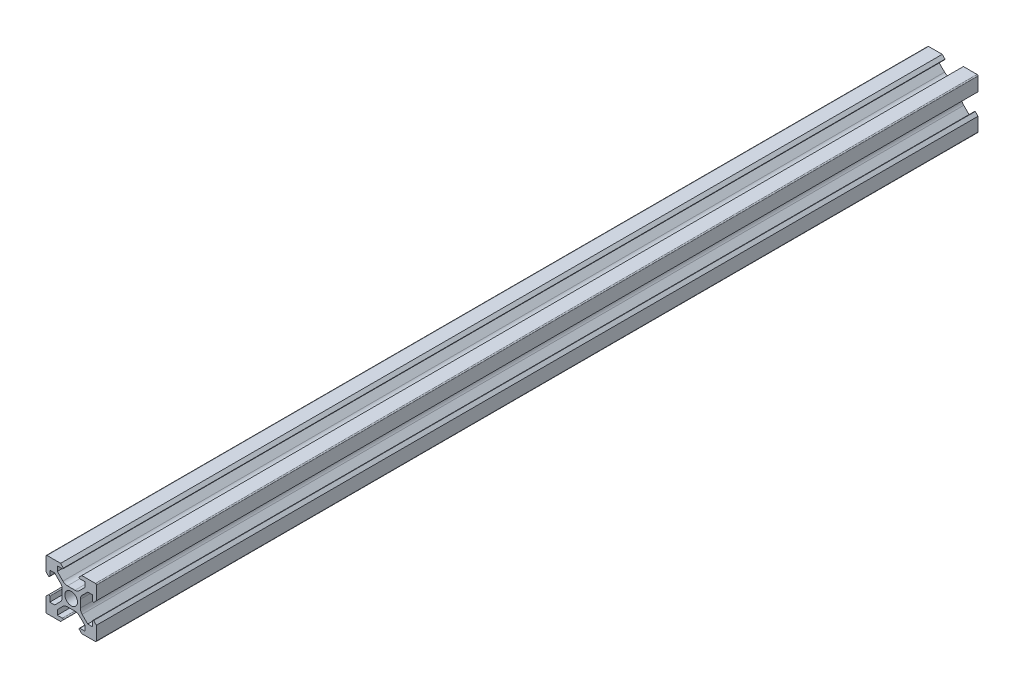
from build123d import *

# Parameters (mm, degrees)
RESSALTO_EXTRUS_O1_DEPTH = 175


with BuildPart() as part:
    # Esbo_o1 → Ressalto-extrus_o1 (new, symmetric)
    with BuildSketch(Plane.XY):
        with BuildLine():
            Line((-3.1, 8.9), (-4.2, 10))
            Line((-4.2, 10), (-9.6, 10))
            ThreePointArc((-9.6, 10), (-9.882842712, 9.882842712), (-10, 9.6))
            Line((-10, 9.6), (-10, 4.2))
            Line((-10, 4.2), (-8.9, 3.1))
            ThreePointArc((-8.9, 3.1), (-8.617157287, 3.217157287), (-8.5, 3.5))
            Line((-8.5, 3.5), (-8.5, 5.5))
            Line((-8.5, 5.5), (-6.560660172, 5.5))
            Line((-6.560660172, 5.5), (-4.332233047, 3.271572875))
            ThreePointArc((-4.332233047, 3.271572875), (-3.790301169, 2.460514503), (-3.6, 1.503805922))
            Line((-3.6, 1.503805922), (-3.6, 0))
            Line((-3.6, 0), (-3.6, -1.503805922))
            ThreePointArc((-3.6, -1.503805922), (-3.790301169, -2.460514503), (-4.332233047, -3.271572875))
            Line((-4.332233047, -3.271572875), (-6.560660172, -5.5))
            Line((-6.560660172, -5.5), (-8.5, -5.5))
            Line((-8.5, -5.5), (-8.5, -3.5))
            ThreePointArc((-8.5, -3.5), (-8.617157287, -3.217157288), (-8.9, -3.1))
            Line((-8.9, -3.1), (-10, -4.2))
            Line((-10, -4.2), (-10, -9.6))
            ThreePointArc((-10, -9.6), (-9.882842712, -9.882842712), (-9.6, -10))
            Line((-9.6, -10), (-4.2, -10))
            Line((-4.2, -10), (-3.1, -8.9))
            ThreePointArc((-3.1, -8.9), (-3.217157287, -8.617157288), (-3.5, -8.5))
            Line((-3.5, -8.5), (-5.5, -8.5))
            Line((-5.5, -8.5), (-5.5, -6.560660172))
            Line((-5.5, -6.560660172), (-3.271572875, -4.332233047))
            ThreePointArc((-3.271572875, -4.332233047), (-2.460514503, -3.790301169), (-1.503805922, -3.6))
            Line((-1.503805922, -3.6), (1.503805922, -3.6))
            ThreePointArc((1.503805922, -3.6), (2.460514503, -3.790301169), (3.271572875, -4.332233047))
            Line((3.271572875, -4.332233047), (5.5, -6.560660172))
            Line((5.5, -6.560660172), (5.5, -8.5))
            Line((5.5, -8.5), (3.5, -8.5))
            ThreePointArc((3.5, -8.5), (3.217157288, -8.617157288), (3.1, -8.9))
            Line((3.1, -8.9), (4.2, -10))
            Line((4.2, -10), (9.6, -10))
            ThreePointArc((9.6, -10), (9.882842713, -9.882842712), (10, -9.6))
            Line((10, -9.6), (10, -4.2))
            Line((10, -4.2), (8.9, -3.1))
            ThreePointArc((8.9, -3.1), (8.617157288, -3.217157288), (8.5, -3.5))
            Line((8.5, -3.5), (8.5, -5.5))
            Line((8.5, -5.5), (6.560660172, -5.5))
            Line((6.560660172, -5.5), (4.332233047, -3.271572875))
            ThreePointArc((4.332233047, -3.271572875), (3.790301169, -2.460514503), (3.6, -1.503805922))
            Line((3.6, -1.503805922), (3.6, 0))
            Line((3.6, 0), (3.6, 1.503805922))
            ThreePointArc((3.6, 1.503805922), (3.790301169, 2.460514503), (4.332233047, 3.271572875))
            Line((4.332233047, 3.271572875), (6.560660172, 5.5))
            Line((6.560660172, 5.5), (8.5, 5.5))
            Line((8.5, 5.5), (8.5, 3.5))
            ThreePointArc((8.5, 3.5), (8.617157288, 3.217157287), (8.9, 3.1))
            Line((8.9, 3.1), (10, 4.2))
            Line((10, 4.2), (10, 9.6))
            ThreePointArc((10, 9.6), (9.882842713, 9.882842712), (9.6, 10))
            Line((9.6, 10), (4.2, 10))
            Line((4.2, 10), (3.1, 8.9))
            ThreePointArc((3.1, 8.9), (3.217157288, 8.617157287), (3.5, 8.5))
            Line((3.5, 8.5), (5.5, 8.5))
            Line((5.5, 8.5), (5.5, 6.560660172))
            Line((5.5, 6.560660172), (3.271572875, 4.332233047))
            ThreePointArc((3.271572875, 4.332233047), (2.460514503, 3.790301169), (1.503805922, 3.6))
            Line((1.503805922, 3.6), (-1.503805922, 3.6))
            ThreePointArc((-1.503805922, 3.6), (-2.460514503, 3.790301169), (-3.271572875, 4.332233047))
            Line((-3.271572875, 4.332233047), (-5.5, 6.560660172))
            Line((-5.5, 6.560660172), (-5.5, 8.5))
            Line((-5.5, 8.5), (-3.5, 8.5))
            ThreePointArc((-3.5, 8.5), (-3.217157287, 8.617157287), (-3.1, 8.9))
        make_face()
        with BuildLine():
            ThreePointArc((2.5, 0), (0, 2.5), (-2.5, 0))
            ThreePointArc((-2.5, 0), (0, -2.5), (2.5, 0))
        make_face(mode=Mode.SUBTRACT)
    extrude(amount=RESSALTO_EXTRUS_O1_DEPTH, both=True)


solid = part.part
